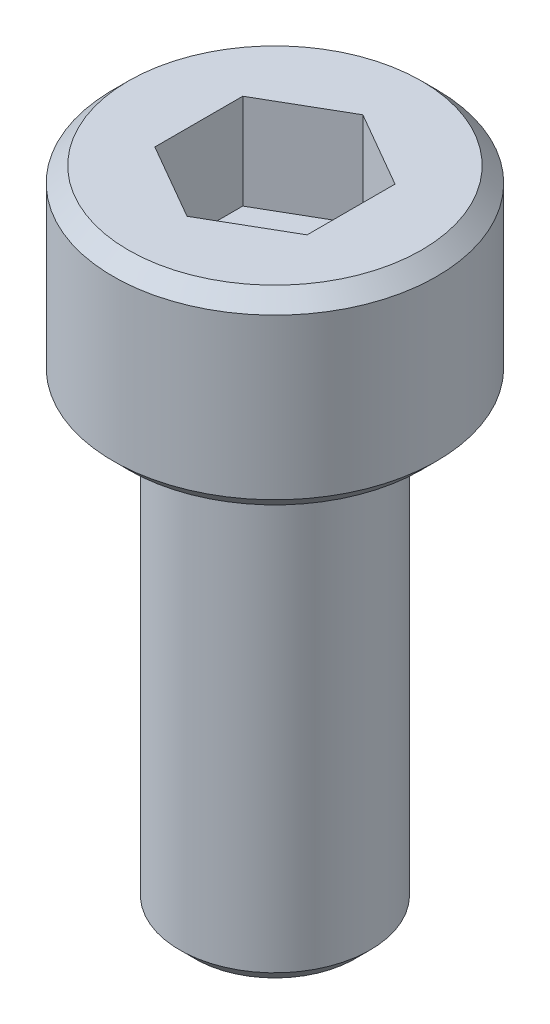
from build123d import *

# Parameters (mm, degrees)
CHANFREIN1_SIZE         = 0.4
ENL_V_MAT_EXTRU_1_DEPTH = 2.5


with BuildPart() as part:
    # Esquisse1 → R_volution1 (revolve)
    with BuildSketch(Plane.XY, mode=Mode.PRIVATE) as r_volution1_sk:
        Polygon((0, 0), (2.5, 0), (2.5, 12), (4.25, 12), (4.25, 17), (0, 17), align=None)
    revolve(r_volution1_sk.sketch.rotate(Axis((0, 0, 0), (0, 1, 0)), 90), axis=Axis((0, 0, 0), (0, 1, 0)))

    # Chanfrein1
    chanfrein1_edges = [part.edges().sort_by_distance(p)[0] for p in [
        (0, 0, 2.5),
        (0, 12, 4.25),
        (0, 17, 4.25),
    ]]
    chamfer(chanfrein1_edges, length=CHANFREIN1_SIZE)

    # Esquisse2 → Enl_v. mat.-Extru.1 (cut)
    with BuildSketch(Plane(origin=(0, 17, 0), x_dir=(-1, 0, 0), z_dir=(0, 1, 0))):
        Polygon((-2, 1.154700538), (-2, -1.154700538), (0, -2.309401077), (2, -1.154700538), (2, 1.154700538), (0, 2.309401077), align=None)
    extrude(amount=-ENL_V_MAT_EXTRU_1_DEPTH, mode=Mode.SUBTRACT)


solid = part.part
